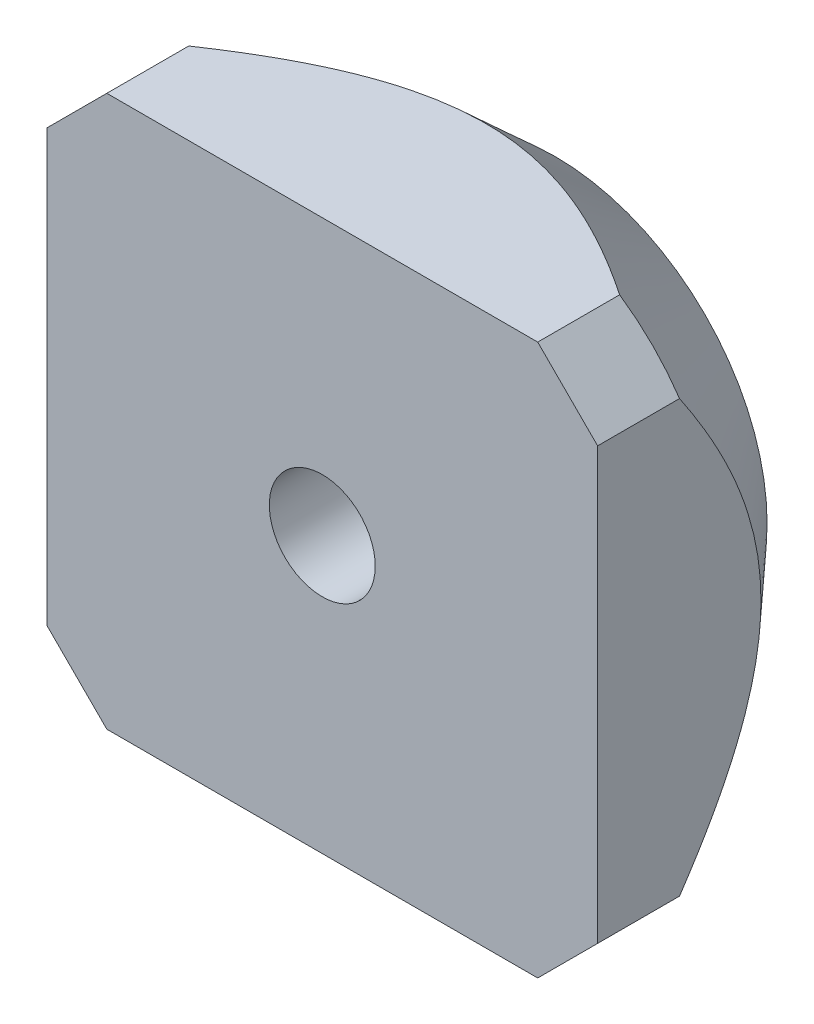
ISO-10303-21;
HEADER;
FILE_DESCRIPTION(('STEP AP214'),'2;1');
FILE_NAME('part.step','',(''),(''),'','','');
FILE_SCHEMA(('AUTOMOTIVE_DESIGN { 1 0 10303 214 1 1 1 1 }'));
ENDSEC;
DATA;
#1=APPLICATION_CONTEXT('core data for automotive mechanical design processes');
#2=APPLICATION_PROTOCOL_DEFINITION('international standard','automotive_design',2000,#1);
#3=PRODUCT_CONTEXT('',#1,'mechanical');
#4=PRODUCT('Part','Part','',(#3));
#5=PRODUCT_RELATED_PRODUCT_CATEGORY('part','',(#4));
#6=PRODUCT_DEFINITION_FORMATION('','',#4);
#7=PRODUCT_DEFINITION_CONTEXT('part definition',#1,'design');
#8=PRODUCT_DEFINITION('design','',#6,#7);
#9=PRODUCT_DEFINITION_SHAPE('','',#8);
#10=(LENGTH_UNIT() NAMED_UNIT(*) SI_UNIT(.MILLI.,.METRE.));
#11=(NAMED_UNIT(*) PLANE_ANGLE_UNIT() SI_UNIT($,.RADIAN.));
#12=(NAMED_UNIT(*) SI_UNIT($,.STERADIAN.) SOLID_ANGLE_UNIT());
#13=UNCERTAINTY_MEASURE_WITH_UNIT(LENGTH_MEASURE(1.E-05),#10,'distance_accuracy_value','');
#14=(GEOMETRIC_REPRESENTATION_CONTEXT(3) GLOBAL_UNCERTAINTY_ASSIGNED_CONTEXT((#13)) GLOBAL_UNIT_ASSIGNED_CONTEXT((#10,
#11,#12)) REPRESENTATION_CONTEXT('',''));
#15=CARTESIAN_POINT('',(0.,0.,0.));
#16=DIRECTION('',(0.,0.,1.));
#17=DIRECTION('',(1.,0.,0.));
#18=AXIS2_PLACEMENT_3D('',#15,#16,#17);
#19=CARTESIAN_POINT('',(0.,0.,-5.5));
#20=DIRECTION('',(0.,0.,1.));
#21=DIRECTION('',(1.,0.,0.));
#22=AXIS2_PLACEMENT_3D('',#19,#20,#21);
#23=PLANE('',#22);
#24=CARTESIAN_POINT('',(0.,0.,-5.5));
#25=DIRECTION('',(0.,0.,1.));
#26=DIRECTION('',(1.,0.,0.));
#27=AXIS2_PLACEMENT_3D('',#24,#25,#26);
#28=CIRCLE('',#27,1.25);
#29=CARTESIAN_POINT('',(1.25,0.,-5.5));
#30=VERTEX_POINT('',#29);
#31=EDGE_CURVE('E246',#30,#30,#28,.T.);
#32=ORIENTED_EDGE('',*,*,#31,.T.);
#33=EDGE_LOOP('',(#32));
#34=FACE_BOUND('',#33,.T.);
#35=CARTESIAN_POINT('',(0.,0.,-5.50000000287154));
#36=DIRECTION('',(0.,0.,1.));
#37=DIRECTION('',(1.,0.,0.));
#38=AXIS2_PLACEMENT_3D('',#35,#36,#37);
#39=CIRCLE('',#38,5.00000000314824);
#40=CARTESIAN_POINT('',(5.00000000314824,0.,-5.50000000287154));
#41=VERTEX_POINT('',#40);
#42=EDGE_CURVE('E33',#41,#41,#39,.T.);
#43=ORIENTED_EDGE('',*,*,#42,.F.);
#44=EDGE_LOOP('',(#43));
#45=FACE_BOUND('',#44,.T.);
#46=ADVANCED_FACE('F30',(#34,#45),#23,.F.);
#47=CARTESIAN_POINT('',(0.,0.,-1.91193420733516));
#48=DIRECTION('',(0.,0.,1.));
#49=DIRECTION('',(1.,0.,0.));
#50=AXIS2_PLACEMENT_3D('',#47,#48,#49);
#51=CONICAL_SURFACE('',#50,8.27271392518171,0.739466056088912);
#52=ORIENTED_EDGE('',*,*,#42,.T.);
#53=EDGE_LOOP('',(#52));
#54=FACE_BOUND('',#53,.T.);
#55=CARTESIAN_POINT('',(-6.49999999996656,5.08578643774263,-1.93333420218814));
#56=CARTESIAN_POINT('',(-6.49999999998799,4.97217656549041,-2.01007902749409));
#57=CARTESIAN_POINT('',(-6.49999999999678,4.85782950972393,-2.08574579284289));
#58=CARTESIAN_POINT('',(-6.50000000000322,4.62749756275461,-2.23459577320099));
#59=CARTESIAN_POINT('',(-6.50000000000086,4.51151233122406,-2.30777846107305));
#60=CARTESIAN_POINT('',(-6.49999999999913,4.27735001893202,-2.45156937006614));
#61=CARTESIAN_POINT('',(-6.49999999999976,4.15916634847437,-2.52216690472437));
#62=CARTESIAN_POINT('',(-6.50000000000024,3.92090179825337,-2.66006146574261));
#63=CARTESIAN_POINT('',(-6.50000000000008,3.80082102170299,-2.72735867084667));
#64=CARTESIAN_POINT('',(-6.49999999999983,3.43117049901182,-2.927024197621));
#65=CARTESIAN_POINT('',(-6.49999999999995,3.17828163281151,-3.05336340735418));
#66=CARTESIAN_POINT('',(-6.50000000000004,2.66320472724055,-3.2847897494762));
#67=CARTESIAN_POINT('',(-6.50000000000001,2.40103115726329,-3.38990837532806));
#68=CARTESIAN_POINT('',(-6.49999999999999,1.96194937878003,-3.54007016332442));
#69=CARTESIAN_POINT('',(-6.5,1.78780916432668,-3.5931930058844));
#70=CARTESIAN_POINT('',(-6.5,1.43593803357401,-3.68604206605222));
#71=CARTESIAN_POINT('',(-6.5,1.25820705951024,-3.72576806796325));
#72=CARTESIAN_POINT('',(-6.5,0.901971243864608,-3.78972854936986));
#73=CARTESIAN_POINT('',(-6.5,0.723496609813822,-3.81412921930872));
#74=CARTESIAN_POINT('',(-6.5,0.365074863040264,-3.84691624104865));
#75=CARTESIAN_POINT('',(-6.5,0.185127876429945,-3.85530395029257));
#76=CARTESIAN_POINT('',(-6.5,-0.175331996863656,-3.85561829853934));
#77=CARTESIAN_POINT('',(-6.5,-0.355844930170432,-3.84749448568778));
#78=CARTESIAN_POINT('',(-6.5,-0.715412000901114,-3.81512247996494));
#79=CARTESIAN_POINT('',(-6.5,-0.894466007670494,-3.79087285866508));
#80=CARTESIAN_POINT('',(-6.5,-1.25186987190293,-3.72710369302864));
#81=CARTESIAN_POINT('',(-6.5,-1.43018938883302,-3.6874161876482));
#82=CARTESIAN_POINT('',(-6.5,-1.7832209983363,-3.59454247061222));
#83=CARTESIAN_POINT('',(-6.5,-1.95793314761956,-3.54135647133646));
#84=CARTESIAN_POINT('',(-6.5,-2.39791270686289,-3.39110767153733));
#85=CARTESIAN_POINT('',(-6.5,-2.66041462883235,-3.2859613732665));
#86=CARTESIAN_POINT('',(-6.5,-3.17612601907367,-3.05441341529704));
#87=CARTESIAN_POINT('',(-6.5,-3.4293209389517,-2.92798006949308));
#88=CARTESIAN_POINT('',(-6.5,-3.79940591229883,-2.72814379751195));
#89=CARTESIAN_POINT('',(-6.5,-3.91962359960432,-2.66078705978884));
#90=CARTESIAN_POINT('',(-6.5,-4.15815744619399,-2.52276484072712));
#91=CARTESIAN_POINT('',(-6.5,-4.27647350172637,-2.45209917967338));
#92=CARTESIAN_POINT('',(-6.5,-4.510894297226,-2.30816632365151));
#93=CARTESIAN_POINT('',(-6.5,-4.62700566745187,-2.23490988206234));
#94=CARTESIAN_POINT('',(-6.5,-4.85758619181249,-2.08590677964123));
#95=CARTESIAN_POINT('',(-6.5,-4.97205568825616,-2.01016064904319));
#96=CARTESIAN_POINT('',(-6.5,-5.08578643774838,-1.93333420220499));
#97=B_SPLINE_CURVE_WITH_KNOTS('',3,(#55,#56,#57,#58,#59,#60,#61,#62,#63,#64,#65,#66,#67,#68,#69,
#70,#71,#72,#73,#74,#75,#76,#77,#78,#79,#80,#81,#82,#83,#84,#85,#86,#87,#88,#89,#90,#91,#92,#93,
#94,#95,#96),.UNSPECIFIED.,.F.,.F.,(4,2,2,2,2,2,2,2,2,2,2,2,2,2,2,2,2,2,2,2,4),(0.,
0.41131042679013,0.822707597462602,1.23564791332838,1.64856583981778,2.49590493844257,
3.34197710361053,3.88772071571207,4.43347311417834,4.97320018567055,5.51288150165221,
6.05421432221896,6.59559510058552,7.1430386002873,7.69047348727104,8.53748456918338,
9.38576777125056,9.79913116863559,10.2125170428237,10.6243522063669,11.0361002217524),.UNSPECIFIED.);
#98=CARTESIAN_POINT('',(-6.50000000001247,5.08578643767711,-1.93333420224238));
#99=VERTEX_POINT('',#98);
#100=CARTESIAN_POINT('',(-6.50000000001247,-5.08578643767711,-1.93333420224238));
#101=VERTEX_POINT('',#100);
#102=EDGE_CURVE('E159',#99,#101,#97,.T.);
#103=ORIENTED_EDGE('',*,*,#102,.F.);
#104=CARTESIAN_POINT('',(-5.08578643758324,6.50000000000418,-1.93333420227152));
#105=CARTESIAN_POINT('',(-5.20320338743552,6.38258305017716,-1.95544496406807));
#106=CARTESIAN_POINT('',(-5.32114245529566,6.26464398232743,-1.97213629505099));
#107=CARTESIAN_POINT('',(-5.55702028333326,6.02876615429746,-1.99438943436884));
#108=CARTESIAN_POINT('',(-5.6749567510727,5.9108296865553,-2.00000000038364));
#109=CARTESIAN_POINT('',(-5.91082968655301,5.67495675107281,-2.00000000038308));
#110=CARTESIAN_POINT('',(-6.02876615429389,5.55702028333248,-1.99438943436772));
#111=CARTESIAN_POINT('',(-6.2646439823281,5.32114245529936,-1.97213629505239));
#112=CARTESIAN_POINT('',(-6.38258305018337,5.20320338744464,-1.95544496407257));
#113=CARTESIAN_POINT('',(-6.50000000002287,5.08578643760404,-1.93333420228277));
#114=B_SPLINE_CURVE_WITH_KNOTS('',3,(#104,#105,#106,#107,#108,#109,#110,#111,#112,#113),
.UNSPECIFIED.,.F.,.F.,(4,2,2,2,4),(0.,0.502492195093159,1.00276834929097,1.50304450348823,
2.00553669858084),.UNSPECIFIED.);
#115=CARTESIAN_POINT('',(-5.08578643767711,6.50000000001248,-1.93333420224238));
#116=VERTEX_POINT('',#115);
#117=EDGE_CURVE('E165',#116,#99,#114,.T.);
#118=ORIENTED_EDGE('',*,*,#117,.F.);
#119=CARTESIAN_POINT('',(5.08578643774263,6.49999999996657,-1.93333420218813));
#120=CARTESIAN_POINT('',(4.9721765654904,6.49999999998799,-2.01007902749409));
#121=CARTESIAN_POINT('',(4.85782950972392,6.49999999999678,-2.08574579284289));
#122=CARTESIAN_POINT('',(4.62749756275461,6.50000000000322,-2.23459577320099));
#123=CARTESIAN_POINT('',(4.51151233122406,6.50000000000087,-2.30777846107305));
#124=CARTESIAN_POINT('',(4.27735001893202,6.49999999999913,-2.45156937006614));
#125=CARTESIAN_POINT('',(4.15916634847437,6.49999999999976,-2.52216690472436));
#126=CARTESIAN_POINT('',(3.92090179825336,6.50000000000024,-2.66006146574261));
#127=CARTESIAN_POINT('',(3.80082102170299,6.50000000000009,-2.72735867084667));
#128=CARTESIAN_POINT('',(3.43117049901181,6.49999999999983,-2.927024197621));
#129=CARTESIAN_POINT('',(3.17828163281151,6.49999999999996,-3.05336340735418));
#130=CARTESIAN_POINT('',(2.66320472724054,6.50000000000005,-3.2847897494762));
#131=CARTESIAN_POINT('',(2.40103115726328,6.50000000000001,-3.38990837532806));
#132=CARTESIAN_POINT('',(1.96194937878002,6.5,-3.54007016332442));
#133=CARTESIAN_POINT('',(1.78780916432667,6.5,-3.5931930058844));
#134=CARTESIAN_POINT('',(1.435938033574,6.50000000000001,-3.68604206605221));
#135=CARTESIAN_POINT('',(1.25820705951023,6.5,-3.72576806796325));
#136=CARTESIAN_POINT('',(0.901971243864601,6.5,-3.78972854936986));
#137=CARTESIAN_POINT('',(0.723496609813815,6.5,-3.81412921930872));
#138=CARTESIAN_POINT('',(0.365074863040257,6.5,-3.84691624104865));
#139=CARTESIAN_POINT('',(0.185127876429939,6.5,-3.85530395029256));
#140=CARTESIAN_POINT('',(-0.175331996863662,6.5,-3.85561829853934));
#141=CARTESIAN_POINT('',(-0.355844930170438,6.5,-3.84749448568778));
#142=CARTESIAN_POINT('',(-0.715412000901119,6.5,-3.81512247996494));
#143=CARTESIAN_POINT('',(-0.8944660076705,6.5,-3.79087285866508));
#144=CARTESIAN_POINT('',(-1.25186987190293,6.5,-3.72710369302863));
#145=CARTESIAN_POINT('',(-1.43018938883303,6.5,-3.68741618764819));
#146=CARTESIAN_POINT('',(-1.7832209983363,6.5,-3.59454247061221));
#147=CARTESIAN_POINT('',(-1.95793314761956,6.5,-3.54135647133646));
#148=CARTESIAN_POINT('',(-2.3979127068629,6.5,-3.39110767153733));
#149=CARTESIAN_POINT('',(-2.66041462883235,6.5,-3.2859613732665));
#150=CARTESIAN_POINT('',(-3.17612601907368,6.5,-3.05441341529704));
#151=CARTESIAN_POINT('',(-3.4293209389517,6.5,-2.92798006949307));
#152=CARTESIAN_POINT('',(-3.79940591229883,6.5,-2.72814379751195));
#153=CARTESIAN_POINT('',(-3.91962359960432,6.5,-2.66078705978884));
#154=CARTESIAN_POINT('',(-4.15815744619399,6.5,-2.52276484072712));
#155=CARTESIAN_POINT('',(-4.27647350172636,6.5,-2.45209917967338));
#156=CARTESIAN_POINT('',(-4.510894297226,6.5,-2.30816632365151));
#157=CARTESIAN_POINT('',(-4.62700566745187,6.5,-2.23490988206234));
#158=CARTESIAN_POINT('',(-4.85758619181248,6.5,-2.08590677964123));
#159=CARTESIAN_POINT('',(-4.97205568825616,6.5,-2.01016064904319));
#160=CARTESIAN_POINT('',(-5.08578643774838,6.5,-1.93333420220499));
#161=B_SPLINE_CURVE_WITH_KNOTS('',3,(#119,#120,#121,#122,#123,#124,#125,#126,#127,#128,#129,
#130,#131,#132,#133,#134,#135,#136,#137,#138,#139,#140,#141,#142,#143,#144,#145,#146,#147,#148,
#149,#150,#151,#152,#153,#154,#155,#156,#157,#158,#159,#160),.UNSPECIFIED.,.F.,.F.,(4,2,2,2,2,2,
2,2,2,2,2,2,2,2,2,2,2,2,2,2,4),(0.,0.411310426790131,0.822707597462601,1.23564791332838,
1.64856583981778,2.49590493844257,3.34197710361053,3.88772071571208,4.43347311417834,
4.97320018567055,5.51288150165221,6.05421432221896,6.59559510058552,7.1430386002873,
7.69047348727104,8.53748456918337,9.38576777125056,9.79913116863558,10.2125170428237,
10.6243522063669,11.0361002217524),.UNSPECIFIED.);
#162=CARTESIAN_POINT('',(5.08578643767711,6.50000000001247,-1.93333420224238));
#163=VERTEX_POINT('',#162);
#164=EDGE_CURVE('E99',#163,#116,#161,.T.);
#165=ORIENTED_EDGE('',*,*,#164,.F.);
#166=CARTESIAN_POINT('',(6.50000000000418,5.08578643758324,-1.93333420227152));
#167=CARTESIAN_POINT('',(6.38258305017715,5.20320338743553,-1.95544496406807));
#168=CARTESIAN_POINT('',(6.26464398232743,5.32114245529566,-1.97213629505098));
#169=CARTESIAN_POINT('',(6.02876615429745,5.55702028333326,-1.99438943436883));
#170=CARTESIAN_POINT('',(5.9108296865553,5.6749567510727,-2.00000000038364));
#171=CARTESIAN_POINT('',(5.67495675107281,5.91082968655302,-2.00000000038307));
#172=CARTESIAN_POINT('',(5.55702028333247,6.02876615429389,-1.99438943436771));
#173=CARTESIAN_POINT('',(5.32114245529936,6.2646439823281,-1.97213629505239));
#174=CARTESIAN_POINT('',(5.20320338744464,6.38258305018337,-1.95544496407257));
#175=CARTESIAN_POINT('',(5.08578643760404,6.50000000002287,-1.93333420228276));
#176=B_SPLINE_CURVE_WITH_KNOTS('',3,(#166,#167,#168,#169,#170,#171,#172,#173,#174,#175),
.UNSPECIFIED.,.F.,.F.,(4,2,2,2,4),(0.,0.502492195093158,1.00276834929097,1.50304450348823,
2.00553669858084),.UNSPECIFIED.);
#177=CARTESIAN_POINT('',(6.50000000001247,5.08578643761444,-1.93333420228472));
#178=VERTEX_POINT('',#177);
#179=EDGE_CURVE('E93',#178,#163,#176,.T.);
#180=ORIENTED_EDGE('',*,*,#179,.F.);
#181=CARTESIAN_POINT('',(6.49999999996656,-5.08578643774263,-1.93333420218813));
#182=CARTESIAN_POINT('',(6.49999999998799,-4.97217656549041,-2.01007902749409));
#183=CARTESIAN_POINT('',(6.49999999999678,-4.85782950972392,-2.08574579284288));
#184=CARTESIAN_POINT('',(6.50000000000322,-4.62749756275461,-2.23459577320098));
#185=CARTESIAN_POINT('',(6.50000000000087,-4.51151233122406,-2.30777846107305));
#186=CARTESIAN_POINT('',(6.49999999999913,-4.27735001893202,-2.45156937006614));
#187=CARTESIAN_POINT('',(6.49999999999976,-4.15916634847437,-2.52216690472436));
#188=CARTESIAN_POINT('',(6.50000000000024,-3.92090179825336,-2.6600614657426));
#189=CARTESIAN_POINT('',(6.50000000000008,-3.80082102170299,-2.72735867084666));
#190=CARTESIAN_POINT('',(6.49999999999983,-3.43117049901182,-2.927024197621));
#191=CARTESIAN_POINT('',(6.49999999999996,-3.17828163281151,-3.05336340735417));
#192=CARTESIAN_POINT('',(6.50000000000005,-2.66320472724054,-3.2847897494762));
#193=CARTESIAN_POINT('',(6.50000000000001,-2.40103115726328,-3.38990837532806));
#194=CARTESIAN_POINT('',(6.49999999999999,-1.96194937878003,-3.54007016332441));
#195=CARTESIAN_POINT('',(6.5,-1.78780916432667,-3.5931930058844));
#196=CARTESIAN_POINT('',(6.5,-1.435938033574,-3.68604206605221));
#197=CARTESIAN_POINT('',(6.5,-1.25820705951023,-3.72576806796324));
#198=CARTESIAN_POINT('',(6.5,-0.901971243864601,-3.78972854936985));
#199=CARTESIAN_POINT('',(6.5,-0.723496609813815,-3.81412921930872));
#200=CARTESIAN_POINT('',(6.5,-0.365074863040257,-3.84691624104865));
#201=CARTESIAN_POINT('',(6.5,-0.185127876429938,-3.85530395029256));
#202=CARTESIAN_POINT('',(6.5,0.175331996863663,-3.85561829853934));
#203=CARTESIAN_POINT('',(6.5,0.355844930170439,-3.84749448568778));
#204=CARTESIAN_POINT('',(6.5,0.715412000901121,-3.81512247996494));
#205=CARTESIAN_POINT('',(6.5,0.894466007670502,-3.79087285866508));
#206=CARTESIAN_POINT('',(6.5,1.25186987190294,-3.72710369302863));
#207=CARTESIAN_POINT('',(6.5,1.43018938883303,-3.68741618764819));
#208=CARTESIAN_POINT('',(6.5,1.7832209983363,-3.59454247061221));
#209=CARTESIAN_POINT('',(6.5,1.95793314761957,-3.54135647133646));
#210=CARTESIAN_POINT('',(6.5,2.3979127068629,-3.39110767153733));
#211=CARTESIAN_POINT('',(6.5,2.66041462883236,-3.2859613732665));
#212=CARTESIAN_POINT('',(6.5,3.17612601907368,-3.05441341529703));
#213=CARTESIAN_POINT('',(6.5,3.42932093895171,-2.92798006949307));
#214=CARTESIAN_POINT('',(6.5,3.79940591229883,-2.72814379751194));
#215=CARTESIAN_POINT('',(6.5,3.91962359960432,-2.66078705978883));
#216=CARTESIAN_POINT('',(6.5,4.15815744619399,-2.52276484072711));
#217=CARTESIAN_POINT('',(6.5,4.27647350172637,-2.45209917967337));
#218=CARTESIAN_POINT('',(6.5,4.51089429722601,-2.30816632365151));
#219=CARTESIAN_POINT('',(6.5,4.62700566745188,-2.23490988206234));
#220=CARTESIAN_POINT('',(6.5,4.85758619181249,-2.08590677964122));
#221=CARTESIAN_POINT('',(6.5,4.97205568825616,-2.01016064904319));
#222=CARTESIAN_POINT('',(6.5,5.08578643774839,-1.93333420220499));
#223=B_SPLINE_CURVE_WITH_KNOTS('',3,(#181,#182,#183,#184,#185,#186,#187,#188,#189,#190,#191,
#192,#193,#194,#195,#196,#197,#198,#199,#200,#201,#202,#203,#204,#205,#206,#207,#208,#209,#210,
#211,#212,#213,#214,#215,#216,#217,#218,#219,#220,#221,#222),.UNSPECIFIED.,.F.,.F.,(4,2,2,2,2,2,
2,2,2,2,2,2,2,2,2,2,2,2,2,2,4),(0.,0.411310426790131,0.822707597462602,1.23564791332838,
1.64856583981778,2.49590493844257,3.34197710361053,3.88772071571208,4.43347311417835,
4.97320018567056,5.51288150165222,6.05421432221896,6.59559510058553,7.14303860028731,
7.69047348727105,8.53748456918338,9.38576777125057,9.79913116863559,10.2125170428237,
10.6243522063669,11.0361002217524),.UNSPECIFIED.);
#224=CARTESIAN_POINT('',(6.50000000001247,-5.08578643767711,-1.93333420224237));
#225=VERTEX_POINT('',#224);
#226=EDGE_CURVE('E97',#225,#178,#223,.T.);
#227=ORIENTED_EDGE('',*,*,#226,.F.);
#228=CARTESIAN_POINT('',(5.08578643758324,-6.50000000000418,-1.93333420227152));
#229=CARTESIAN_POINT('',(5.20320338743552,-6.38258305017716,-1.95544496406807));
#230=CARTESIAN_POINT('',(5.32114245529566,-6.26464398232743,-1.97213629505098));
#231=CARTESIAN_POINT('',(5.55702028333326,-6.02876615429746,-1.99438943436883));
#232=CARTESIAN_POINT('',(5.6749567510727,-5.9108296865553,-2.00000000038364));
#233=CARTESIAN_POINT('',(5.91082968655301,-5.67495675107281,-2.00000000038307));
#234=CARTESIAN_POINT('',(6.02876615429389,-5.55702028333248,-1.99438943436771));
#235=CARTESIAN_POINT('',(6.2646439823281,-5.32114245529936,-1.97213629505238));
#236=CARTESIAN_POINT('',(6.38258305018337,-5.20320338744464,-1.95544496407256));
#237=CARTESIAN_POINT('',(6.50000000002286,-5.08578643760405,-1.93333420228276));
#238=B_SPLINE_CURVE_WITH_KNOTS('',3,(#228,#229,#230,#231,#232,#233,#234,#235,#236,#237),
.UNSPECIFIED.,.F.,.F.,(4,2,2,2,4),(0.,0.502492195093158,1.00276834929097,1.50304450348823,
2.00553669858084),.UNSPECIFIED.);
#239=CARTESIAN_POINT('',(5.08578643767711,-6.50000000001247,-1.93333420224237));
#240=VERTEX_POINT('',#239);
#241=EDGE_CURVE('E113',#240,#225,#238,.T.);
#242=ORIENTED_EDGE('',*,*,#241,.F.);
#243=CARTESIAN_POINT('',(-5.08578643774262,-6.49999999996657,-1.93333420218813));
#244=CARTESIAN_POINT('',(-4.9721765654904,-6.49999999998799,-2.01007902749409));
#245=CARTESIAN_POINT('',(-4.85782950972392,-6.49999999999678,-2.08574579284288));
#246=CARTESIAN_POINT('',(-4.62749756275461,-6.50000000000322,-2.23459577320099));
#247=CARTESIAN_POINT('',(-4.51151233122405,-6.50000000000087,-2.30777846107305));
#248=CARTESIAN_POINT('',(-4.27735001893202,-6.49999999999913,-2.45156937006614));
#249=CARTESIAN_POINT('',(-4.15916634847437,-6.49999999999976,-2.52216690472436));
#250=CARTESIAN_POINT('',(-3.92090179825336,-6.50000000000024,-2.6600614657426));
#251=CARTESIAN_POINT('',(-3.80082102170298,-6.50000000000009,-2.72735867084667));
#252=CARTESIAN_POINT('',(-3.43117049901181,-6.49999999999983,-2.927024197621));
#253=CARTESIAN_POINT('',(-3.1782816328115,-6.49999999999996,-3.05336340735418));
#254=CARTESIAN_POINT('',(-2.66320472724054,-6.50000000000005,-3.2847897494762));
#255=CARTESIAN_POINT('',(-2.40103115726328,-6.50000000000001,-3.38990837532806));
#256=CARTESIAN_POINT('',(-1.96194937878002,-6.5,-3.54007016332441));
#257=CARTESIAN_POINT('',(-1.78780916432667,-6.5,-3.5931930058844));
#258=CARTESIAN_POINT('',(-1.435938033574,-6.5,-3.68604206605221));
#259=CARTESIAN_POINT('',(-1.25820705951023,-6.5,-3.72576806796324));
#260=CARTESIAN_POINT('',(-0.9019712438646,-6.5,-3.78972854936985));
#261=CARTESIAN_POINT('',(-0.723496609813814,-6.5,-3.81412921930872));
#262=CARTESIAN_POINT('',(-0.365074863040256,-6.5,-3.84691624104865));
#263=CARTESIAN_POINT('',(-0.185127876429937,-6.5,-3.85530395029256));
#264=CARTESIAN_POINT('',(0.175331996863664,-6.5,-3.85561829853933));
#265=CARTESIAN_POINT('',(0.35584493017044,-6.5,-3.84749448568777));
#266=CARTESIAN_POINT('',(0.715412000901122,-6.5,-3.81512247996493));
#267=CARTESIAN_POINT('',(0.894466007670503,-6.5,-3.79087285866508));
#268=CARTESIAN_POINT('',(1.25186987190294,-6.5,-3.72710369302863));
#269=CARTESIAN_POINT('',(1.43018938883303,-6.5,-3.68741618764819));
#270=CARTESIAN_POINT('',(1.7832209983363,-6.5,-3.59454247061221));
#271=CARTESIAN_POINT('',(1.95793314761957,-6.5,-3.54135647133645));
#272=CARTESIAN_POINT('',(2.3979127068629,-6.5,-3.39110767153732));
#273=CARTESIAN_POINT('',(2.66041462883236,-6.5,-3.28596137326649));
#274=CARTESIAN_POINT('',(3.17612601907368,-6.5,-3.05441341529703));
#275=CARTESIAN_POINT('',(3.42932093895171,-6.5,-2.92798006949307));
#276=CARTESIAN_POINT('',(3.79940591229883,-6.5,-2.72814379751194));
#277=CARTESIAN_POINT('',(3.91962359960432,-6.5,-2.66078705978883));
#278=CARTESIAN_POINT('',(4.15815744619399,-6.5,-2.52276484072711));
#279=CARTESIAN_POINT('',(4.27647350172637,-6.5,-2.45209917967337));
#280=CARTESIAN_POINT('',(4.510894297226,-6.5,-2.30816632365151));
#281=CARTESIAN_POINT('',(4.62700566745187,-6.5,-2.23490988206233));
#282=CARTESIAN_POINT('',(4.85758619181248,-6.5,-2.08590677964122));
#283=CARTESIAN_POINT('',(4.97205568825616,-6.5,-2.01016064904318));
#284=CARTESIAN_POINT('',(5.08578643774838,-6.5,-1.93333420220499));
#285=B_SPLINE_CURVE_WITH_KNOTS('',3,(#243,#244,#245,#246,#247,#248,#249,#250,#251,#252,#253,
#254,#255,#256,#257,#258,#259,#260,#261,#262,#263,#264,#265,#266,#267,#268,#269,#270,#271,#272,
#273,#274,#275,#276,#277,#278,#279,#280,#281,#282,#283,#284),.UNSPECIFIED.,.F.,.F.,(4,2,2,2,2,2,
2,2,2,2,2,2,2,2,2,2,2,2,2,2,4),(0.,0.411310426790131,0.822707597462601,1.23564791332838,
1.64856583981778,2.49590493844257,3.34197710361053,3.88772071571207,4.43347311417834,
4.97320018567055,5.51288150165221,6.05421432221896,6.59559510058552,7.1430386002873,
7.69047348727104,8.53748456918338,9.38576777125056,9.79913116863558,10.2125170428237,
10.6243522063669,11.0361002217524),.UNSPECIFIED.);
#286=CARTESIAN_POINT('',(-5.08578643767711,-6.50000000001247,-1.93333420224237));
#287=VERTEX_POINT('',#286);
#288=EDGE_CURVE('E146',#287,#240,#285,.T.);
#289=ORIENTED_EDGE('',*,*,#288,.F.);
#290=CARTESIAN_POINT('',(-6.50000000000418,-5.08578643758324,-1.93333420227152));
#291=CARTESIAN_POINT('',(-6.38258305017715,-5.20320338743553,-1.95544496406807));
#292=CARTESIAN_POINT('',(-6.26464398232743,-5.32114245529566,-1.97213629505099));
#293=CARTESIAN_POINT('',(-6.02876615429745,-5.55702028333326,-1.99438943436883));
#294=CARTESIAN_POINT('',(-5.9108296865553,-5.6749567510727,-2.00000000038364));
#295=CARTESIAN_POINT('',(-5.6749567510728,-5.91082968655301,-2.00000000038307));
#296=CARTESIAN_POINT('',(-5.55702028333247,-6.02876615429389,-1.99438943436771));
#297=CARTESIAN_POINT('',(-5.32114245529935,-6.2646439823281,-1.97213629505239));
#298=CARTESIAN_POINT('',(-5.20320338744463,-6.38258305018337,-1.95544496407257));
#299=CARTESIAN_POINT('',(-5.08578643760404,-6.50000000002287,-1.93333420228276));
#300=B_SPLINE_CURVE_WITH_KNOTS('',3,(#290,#291,#292,#293,#294,#295,#296,#297,#298,#299),
.UNSPECIFIED.,.F.,.F.,(4,2,2,2,4),(0.,0.50249219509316,1.00276834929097,1.50304450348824,
2.00553669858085),.UNSPECIFIED.);
#301=EDGE_CURVE('E153',#101,#287,#300,.T.);
#302=ORIENTED_EDGE('',*,*,#301,.F.);
#303=EDGE_LOOP('',(#103,#118,#165,#180,#227,#242,#289,#302));
#304=FACE_BOUND('',#303,.T.);
#305=ADVANCED_FACE('F95',(#54,#304),#51,.T.);
#306=CARTESIAN_POINT('',(6.5,5.08578643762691,0.));
#307=DIRECTION('',(0.707106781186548,0.707106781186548,0.));
#308=DIRECTION('',(-0.707106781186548,0.707106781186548,0.));
#309=AXIS2_PLACEMENT_3D('',#306,#307,#308);
#310=PLANE('',#309);
#311=DIRECTION('',(-0.707106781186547,0.707106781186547,0.));
#312=VECTOR('',#311,1.);
#313=CARTESIAN_POINT('',(6.5,5.08578643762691,0.));
#314=LINE('',#313,#312);
#315=CARTESIAN_POINT('',(6.5,5.08578643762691,0.));
#316=VERTEX_POINT('',#315);
#317=CARTESIAN_POINT('',(5.08578643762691,6.5,0.));
#318=VERTEX_POINT('',#317);
#319=EDGE_CURVE('E106',#316,#318,#314,.T.);
#320=ORIENTED_EDGE('',*,*,#319,.F.);
#321=DIRECTION('',(0.,0.,-1.));
#322=VECTOR('',#321,1.);
#323=CARTESIAN_POINT('',(6.5,5.08578643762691,0.));
#324=LINE('',#323,#322);
#325=EDGE_CURVE('E103',#178,#316,#324,.F.);
#326=ORIENTED_EDGE('',*,*,#325,.F.);
#327=ORIENTED_EDGE('',*,*,#179,.T.);
#328=DIRECTION('',(0.,0.,1.));
#329=VECTOR('',#328,1.);
#330=CARTESIAN_POINT('',(5.08578643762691,6.5,0.));
#331=LINE('',#330,#329);
#332=EDGE_CURVE('E172',#318,#163,#331,.F.);
#333=ORIENTED_EDGE('',*,*,#332,.F.);
#334=EDGE_LOOP('',(#320,#326,#327,#333));
#335=FACE_BOUND('',#334,.T.);
#336=ADVANCED_FACE('F104',(#335),#310,.T.);
#337=CARTESIAN_POINT('',(5.08578643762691,6.5,0.));
#338=DIRECTION('',(0.,1.,0.));
#339=DIRECTION('',(0.,0.,1.));
#340=AXIS2_PLACEMENT_3D('',#337,#338,#339);
#341=PLANE('',#340);
#342=DIRECTION('',(1.,0.,0.));
#343=VECTOR('',#342,1.);
#344=CARTESIAN_POINT('',(0.,6.5,0.));
#345=LINE('',#344,#343);
#346=CARTESIAN_POINT('',(-5.0857864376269,6.50000000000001,0.));
#347=VERTEX_POINT('',#346);
#348=EDGE_CURVE('E121',#318,#347,#345,.F.);
#349=ORIENTED_EDGE('',*,*,#348,.F.);
#350=ORIENTED_EDGE('',*,*,#332,.T.);
#351=ORIENTED_EDGE('',*,*,#164,.T.);
#352=DIRECTION('',(0.,0.,1.));
#353=VECTOR('',#352,1.);
#354=CARTESIAN_POINT('',(-5.0857864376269,6.50000000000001,0.));
#355=LINE('',#354,#353);
#356=EDGE_CURVE('E171',#347,#116,#355,.F.);
#357=ORIENTED_EDGE('',*,*,#356,.F.);
#358=EDGE_LOOP('',(#349,#350,#351,#357));
#359=FACE_BOUND('',#358,.T.);
#360=ADVANCED_FACE('F180',(#359),#341,.T.);
#361=CARTESIAN_POINT('',(-5.0857864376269,6.50000000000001,0.));
#362=DIRECTION('',(-0.707106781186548,0.707106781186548,0.));
#363=DIRECTION('',(-0.707106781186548,-0.707106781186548,0.));
#364=AXIS2_PLACEMENT_3D('',#361,#362,#363);
#365=PLANE('',#364);
#366=DIRECTION('',(-0.707106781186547,-0.707106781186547,0.));
#367=VECTOR('',#366,1.);
#368=CARTESIAN_POINT('',(-5.0857864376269,6.50000000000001,0.));
#369=LINE('',#368,#367);
#370=CARTESIAN_POINT('',(-6.5,5.08578643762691,0.));
#371=VERTEX_POINT('',#370);
#372=EDGE_CURVE('E219',#347,#371,#369,.T.);
#373=ORIENTED_EDGE('',*,*,#372,.F.);
#374=ORIENTED_EDGE('',*,*,#356,.T.);
#375=ORIENTED_EDGE('',*,*,#117,.T.);
#376=DIRECTION('',(0.,0.,1.));
#377=VECTOR('',#376,1.);
#378=CARTESIAN_POINT('',(-6.5,5.08578643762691,0.));
#379=LINE('',#378,#377);
#380=EDGE_CURVE('E226',#371,#99,#379,.F.);
#381=ORIENTED_EDGE('',*,*,#380,.F.);
#382=EDGE_LOOP('',(#373,#374,#375,#381));
#383=FACE_BOUND('',#382,.T.);
#384=ADVANCED_FACE('F176',(#383),#365,.T.);
#385=CARTESIAN_POINT('',(-6.5,5.08578643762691,0.));
#386=DIRECTION('',(-1.,0.,0.));
#387=DIRECTION('',(0.,0.,1.));
#388=AXIS2_PLACEMENT_3D('',#385,#386,#387);
#389=PLANE('',#388);
#390=DIRECTION('',(0.,1.,0.));
#391=VECTOR('',#390,1.);
#392=CARTESIAN_POINT('',(-6.5,0.,0.));
#393=LINE('',#392,#391);
#394=CARTESIAN_POINT('',(-6.5,-5.08578643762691,0.));
#395=VERTEX_POINT('',#394);
#396=EDGE_CURVE('E217',#371,#395,#393,.F.);
#397=ORIENTED_EDGE('',*,*,#396,.F.);
#398=ORIENTED_EDGE('',*,*,#380,.T.);
#399=ORIENTED_EDGE('',*,*,#102,.T.);
#400=DIRECTION('',(0.,0.,1.));
#401=VECTOR('',#400,1.);
#402=CARTESIAN_POINT('',(-6.5,-5.08578643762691,0.));
#403=LINE('',#402,#401);
#404=EDGE_CURVE('E232',#395,#101,#403,.F.);
#405=ORIENTED_EDGE('',*,*,#404,.F.);
#406=EDGE_LOOP('',(#397,#398,#399,#405));
#407=FACE_BOUND('',#406,.T.);
#408=ADVANCED_FACE('F179',(#407),#389,.T.);
#409=CARTESIAN_POINT('',(-6.5,-5.08578643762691,0.));
#410=DIRECTION('',(-0.707106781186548,-0.707106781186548,0.));
#411=DIRECTION('',(0.707106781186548,-0.707106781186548,0.));
#412=AXIS2_PLACEMENT_3D('',#409,#410,#411);
#413=PLANE('',#412);
#414=DIRECTION('',(0.707106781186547,-0.707106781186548,0.));
#415=VECTOR('',#414,1.);
#416=CARTESIAN_POINT('',(-6.5,-5.08578643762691,0.));
#417=LINE('',#416,#415);
#418=CARTESIAN_POINT('',(-5.08578643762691,-6.5,0.));
#419=VERTEX_POINT('',#418);
#420=EDGE_CURVE('E211',#395,#419,#417,.T.);
#421=ORIENTED_EDGE('',*,*,#420,.F.);
#422=ORIENTED_EDGE('',*,*,#404,.T.);
#423=ORIENTED_EDGE('',*,*,#301,.T.);
#424=DIRECTION('',(0.,0.,-1.));
#425=VECTOR('',#424,1.);
#426=CARTESIAN_POINT('',(-5.08578643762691,-6.5,0.));
#427=LINE('',#426,#425);
#428=EDGE_CURVE('E238',#419,#287,#427,.T.);
#429=ORIENTED_EDGE('',*,*,#428,.F.);
#430=EDGE_LOOP('',(#421,#422,#423,#429));
#431=FACE_BOUND('',#430,.T.);
#432=ADVANCED_FACE('F235',(#431),#413,.T.);
#433=CARTESIAN_POINT('',(-5.08578643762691,-6.5,0.));
#434=DIRECTION('',(0.,-1.,0.));
#435=DIRECTION('',(0.,0.,-1.));
#436=AXIS2_PLACEMENT_3D('',#433,#434,#435);
#437=PLANE('',#436);
#438=DIRECTION('',(1.,0.,0.));
#439=VECTOR('',#438,1.);
#440=CARTESIAN_POINT('',(0.,-6.5,0.));
#441=LINE('',#440,#439);
#442=CARTESIAN_POINT('',(5.08578643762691,-6.5,0.));
#443=VERTEX_POINT('',#442);
#444=EDGE_CURVE('E209',#419,#443,#441,.T.);
#445=ORIENTED_EDGE('',*,*,#444,.F.);
#446=ORIENTED_EDGE('',*,*,#428,.T.);
#447=ORIENTED_EDGE('',*,*,#288,.T.);
#448=DIRECTION('',(0.,0.,1.));
#449=VECTOR('',#448,1.);
#450=CARTESIAN_POINT('',(5.08578643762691,-6.5,0.));
#451=LINE('',#450,#449);
#452=EDGE_CURVE('E110',#443,#240,#451,.F.);
#453=ORIENTED_EDGE('',*,*,#452,.F.);
#454=EDGE_LOOP('',(#445,#446,#447,#453));
#455=FACE_BOUND('',#454,.T.);
#456=ADVANCED_FACE('F242',(#455),#437,.T.);
#457=CARTESIAN_POINT('',(5.08578643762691,-6.5,0.));
#458=DIRECTION('',(0.707106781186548,-0.707106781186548,0.));
#459=DIRECTION('',(0.707106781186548,0.707106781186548,0.));
#460=AXIS2_PLACEMENT_3D('',#457,#458,#459);
#461=PLANE('',#460);
#462=DIRECTION('',(0.707106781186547,0.707106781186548,0.));
#463=VECTOR('',#462,1.);
#464=CARTESIAN_POINT('',(5.08578643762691,-6.5,0.));
#465=LINE('',#464,#463);
#466=CARTESIAN_POINT('',(6.5,-5.08578643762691,0.));
#467=VERTEX_POINT('',#466);
#468=EDGE_CURVE('E39',#443,#467,#465,.T.);
#469=ORIENTED_EDGE('',*,*,#468,.F.);
#470=ORIENTED_EDGE('',*,*,#452,.T.);
#471=ORIENTED_EDGE('',*,*,#241,.T.);
#472=DIRECTION('',(0.,0.,-1.));
#473=VECTOR('',#472,1.);
#474=CARTESIAN_POINT('',(6.5,-5.08578643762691,0.));
#475=LINE('',#474,#473);
#476=EDGE_CURVE('E48',#467,#225,#475,.T.);
#477=ORIENTED_EDGE('',*,*,#476,.F.);
#478=EDGE_LOOP('',(#469,#470,#471,#477));
#479=FACE_BOUND('',#478,.T.);
#480=ADVANCED_FACE('F200',(#479),#461,.T.);
#481=CARTESIAN_POINT('',(6.5,-5.08578643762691,0.));
#482=DIRECTION('',(1.,0.,0.));
#483=DIRECTION('',(0.,0.,-1.));
#484=AXIS2_PLACEMENT_3D('',#481,#482,#483);
#485=PLANE('',#484);
#486=DIRECTION('',(0.,1.,0.));
#487=VECTOR('',#486,1.);
#488=CARTESIAN_POINT('',(6.5,0.,0.));
#489=LINE('',#488,#487);
#490=EDGE_CURVE('E11',#467,#316,#489,.T.);
#491=ORIENTED_EDGE('',*,*,#490,.F.);
#492=ORIENTED_EDGE('',*,*,#476,.T.);
#493=ORIENTED_EDGE('',*,*,#226,.T.);
#494=ORIENTED_EDGE('',*,*,#325,.T.);
#495=EDGE_LOOP('',(#491,#492,#493,#494));
#496=FACE_BOUND('',#495,.T.);
#497=ADVANCED_FACE('F109',(#496),#485,.T.);
#498=CARTESIAN_POINT('',(0.,0.,0.));
#499=DIRECTION('',(0.,0.,1.));
#500=DIRECTION('',(1.,0.,0.));
#501=AXIS2_PLACEMENT_3D('',#498,#499,#500);
#502=PLANE('',#501);
#503=CARTESIAN_POINT('',(0.,0.,0.));
#504=DIRECTION('',(0.,0.,1.));
#505=DIRECTION('',(1.,0.,0.));
#506=AXIS2_PLACEMENT_3D('',#503,#504,#505);
#507=CIRCLE('',#506,1.24999999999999);
#508=CARTESIAN_POINT('',(1.24999999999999,0.,0.));
#509=VERTEX_POINT('',#508);
#510=EDGE_CURVE('E204',#509,#509,#507,.T.);
#511=ORIENTED_EDGE('',*,*,#510,.F.);
#512=EDGE_LOOP('',(#511));
#513=FACE_BOUND('',#512,.T.);
#514=ORIENTED_EDGE('',*,*,#468,.T.);
#515=ORIENTED_EDGE('',*,*,#490,.T.);
#516=ORIENTED_EDGE('',*,*,#319,.T.);
#517=ORIENTED_EDGE('',*,*,#348,.T.);
#518=ORIENTED_EDGE('',*,*,#372,.T.);
#519=ORIENTED_EDGE('',*,*,#396,.T.);
#520=ORIENTED_EDGE('',*,*,#420,.T.);
#521=ORIENTED_EDGE('',*,*,#444,.T.);
#522=EDGE_LOOP('',(#514,#515,#516,#517,#518,#519,#520,#521));
#523=FACE_BOUND('',#522,.T.);
#524=ADVANCED_FACE('F190',(#513,#523),#502,.T.);
#525=CARTESIAN_POINT('',(0.,0.,0.));
#526=DIRECTION('',(0.,0.,1.));
#527=DIRECTION('',(1.,0.,0.));
#528=AXIS2_PLACEMENT_3D('',#525,#526,#527);
#529=CYLINDRICAL_SURFACE('',#528,1.24999999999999);
#530=ORIENTED_EDGE('',*,*,#31,.F.);
#531=EDGE_LOOP('',(#530));
#532=FACE_BOUND('',#531,.T.);
#533=ORIENTED_EDGE('',*,*,#510,.T.);
#534=EDGE_LOOP('',(#533));
#535=FACE_BOUND('',#534,.T.);
#536=ADVANCED_FACE('F192',(#532,#535),#529,.F.);
#537=CLOSED_SHELL('',(#46,#305,#336,#360,#384,#408,#432,#456,#480,#497,#524,#536));
#538=MANIFOLD_SOLID_BREP('B2',#537);
#539=ADVANCED_BREP_SHAPE_REPRESENTATION('',(#18,#538),#14);
#540=SHAPE_DEFINITION_REPRESENTATION(#9,#539);
ENDSEC;
END-ISO-10303-21;
